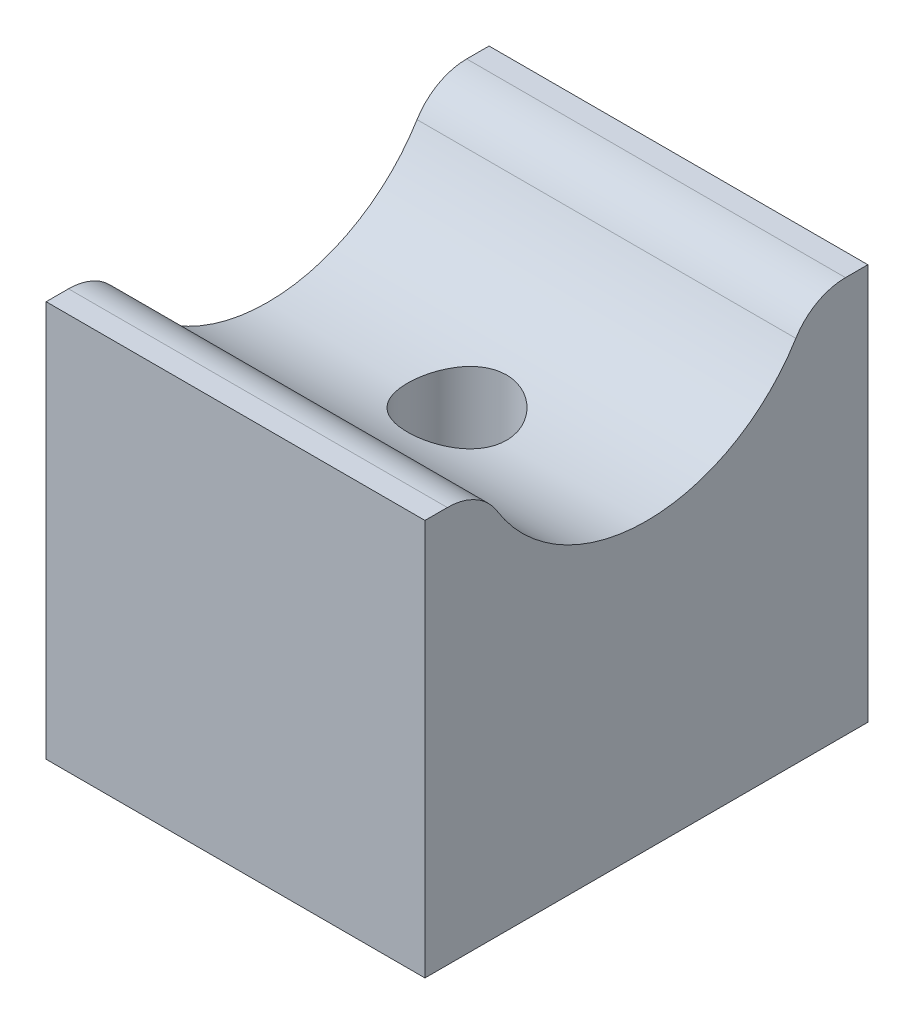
ISO-10303-21;
HEADER;
FILE_DESCRIPTION(('STEP AP214'),'2;1');
FILE_NAME('part.step','',(''),(''),'','','');
FILE_SCHEMA(('AUTOMOTIVE_DESIGN { 1 0 10303 214 1 1 1 1 }'));
ENDSEC;
DATA;
#1=APPLICATION_CONTEXT('core data for automotive mechanical design processes');
#2=APPLICATION_PROTOCOL_DEFINITION('international standard','automotive_design',2000,#1);
#3=PRODUCT_CONTEXT('',#1,'mechanical');
#4=PRODUCT('Part','Part','',(#3));
#5=PRODUCT_RELATED_PRODUCT_CATEGORY('part','',(#4));
#6=PRODUCT_DEFINITION_FORMATION('','',#4);
#7=PRODUCT_DEFINITION_CONTEXT('part definition',#1,'design');
#8=PRODUCT_DEFINITION('design','',#6,#7);
#9=PRODUCT_DEFINITION_SHAPE('','',#8);
#10=(LENGTH_UNIT() NAMED_UNIT(*) SI_UNIT(.MILLI.,.METRE.));
#11=(NAMED_UNIT(*) PLANE_ANGLE_UNIT() SI_UNIT($,.RADIAN.));
#12=(NAMED_UNIT(*) SI_UNIT($,.STERADIAN.) SOLID_ANGLE_UNIT());
#13=UNCERTAINTY_MEASURE_WITH_UNIT(LENGTH_MEASURE(1.E-05),#10,'distance_accuracy_value','');
#14=(GEOMETRIC_REPRESENTATION_CONTEXT(3) GLOBAL_UNCERTAINTY_ASSIGNED_CONTEXT((#13)) GLOBAL_UNIT_ASSIGNED_CONTEXT((#10,
#11,#12)) REPRESENTATION_CONTEXT('',''));
#15=CARTESIAN_POINT('',(0.,0.,0.));
#16=DIRECTION('',(0.,0.,1.));
#17=DIRECTION('',(1.,0.,0.));
#18=AXIS2_PLACEMENT_3D('',#15,#16,#17);
#19=CARTESIAN_POINT('',(16.25,34.,19.));
#20=DIRECTION('',(0.,1.,0.));
#21=DIRECTION('',(0.,0.,1.));
#22=AXIS2_PLACEMENT_3D('',#19,#20,#21);
#23=PLANE('',#22);
#24=DIRECTION('',(0.,0.,-1.));
#25=VECTOR('',#24,1.);
#26=CARTESIAN_POINT('',(16.25,34.,-19.));
#27=LINE('',#26,#25);
#28=CARTESIAN_POINT('',(16.25,34.,19.));
#29=VERTEX_POINT('',#28);
#30=CARTESIAN_POINT('',(16.25,34.,17.0807640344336));
#31=VERTEX_POINT('',#30);
#32=EDGE_CURVE('E109',#29,#31,#27,.T.);
#33=ORIENTED_EDGE('',*,*,#32,.T.);
#34=DIRECTION('',(-1.,0.,0.));
#35=VECTOR('',#34,1.);
#36=CARTESIAN_POINT('',(-16.25,34.,17.0807640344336));
#37=LINE('',#36,#35);
#38=CARTESIAN_POINT('',(-16.25,34.,17.0807640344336));
#39=VERTEX_POINT('',#38);
#40=EDGE_CURVE('E11',#31,#39,#37,.T.);
#41=ORIENTED_EDGE('',*,*,#40,.T.);
#42=DIRECTION('',(0.,0.,1.));
#43=VECTOR('',#42,1.);
#44=CARTESIAN_POINT('',(-16.25,34.,-19.));
#45=LINE('',#44,#43);
#46=CARTESIAN_POINT('',(-16.25,34.,19.));
#47=VERTEX_POINT('',#46);
#48=EDGE_CURVE('E120',#39,#47,#45,.T.);
#49=ORIENTED_EDGE('',*,*,#48,.T.);
#50=DIRECTION('',(1.,0.,0.));
#51=VECTOR('',#50,1.);
#52=CARTESIAN_POINT('',(-16.25,34.,19.));
#53=LINE('',#52,#51);
#54=EDGE_CURVE('E158',#47,#29,#53,.T.);
#55=ORIENTED_EDGE('',*,*,#54,.T.);
#56=EDGE_LOOP('',(#33,#41,#49,#55));
#57=FACE_BOUND('',#56,.T.);
#58=ADVANCED_FACE('F34',(#57),#23,.T.);
#59=CARTESIAN_POINT('',(16.25,34.,-19.));
#60=DIRECTION('',(-1.,0.,0.));
#61=DIRECTION('',(0.,0.,1.));
#62=AXIS2_PLACEMENT_3D('',#59,#60,#61);
#63=PLANE('',#62);
#64=CARTESIAN_POINT('',(16.25,34.,-17.0807640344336));
#65=VERTEX_POINT('',#64);
#66=CARTESIAN_POINT('',(16.25,34.,-19.));
#67=VERTEX_POINT('',#66);
#68=EDGE_CURVE('E102',#65,#67,#27,.T.);
#69=ORIENTED_EDGE('',*,*,#68,.F.);
#70=CARTESIAN_POINT('',(16.25,29.,-17.0807640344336));
#71=DIRECTION('',(-1.,0.,0.));
#72=DIRECTION('',(0.,0.,1.));
#73=AXIS2_PLACEMENT_3D('',#70,#71,#72);
#74=CIRCLE('',#73,5.);
#75=CARTESIAN_POINT('',(16.25,31.6184538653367,-12.8212218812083));
#76=VERTEX_POINT('',#75);
#77=EDGE_CURVE('E47',#65,#76,#74,.F.);
#78=ORIENTED_EDGE('',*,*,#77,.T.);
#79=CARTESIAN_POINT('',(16.25,39.5,0.));
#80=DIRECTION('',(1.,0.,0.));
#81=DIRECTION('',(0.,0.,-1.));
#82=AXIS2_PLACEMENT_3D('',#79,#80,#81);
#83=CIRCLE('',#82,15.05);
#84=CARTESIAN_POINT('',(16.25,31.6184538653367,12.8212218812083));
#85=VERTEX_POINT('',#84);
#86=EDGE_CURVE('E144',#85,#76,#83,.T.);
#87=ORIENTED_EDGE('',*,*,#86,.F.);
#88=CARTESIAN_POINT('',(16.25,29.,17.0807640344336));
#89=DIRECTION('',(-1.,0.,0.));
#90=DIRECTION('',(0.,0.,1.));
#91=AXIS2_PLACEMENT_3D('',#88,#89,#90);
#92=CIRCLE('',#91,5.);
#93=EDGE_CURVE('E54',#85,#31,#92,.F.);
#94=ORIENTED_EDGE('',*,*,#93,.T.);
#95=ORIENTED_EDGE('',*,*,#32,.F.);
#96=DIRECTION('',(0.,-1.,0.));
#97=VECTOR('',#96,1.);
#98=CARTESIAN_POINT('',(16.25,34.,19.));
#99=LINE('',#98,#97);
#100=CARTESIAN_POINT('',(16.25,0.,19.));
#101=VERTEX_POINT('',#100);
#102=EDGE_CURVE('E160',#29,#101,#99,.T.);
#103=ORIENTED_EDGE('',*,*,#102,.T.);
#104=DIRECTION('',(0.,0.,-1.));
#105=VECTOR('',#104,1.);
#106=CARTESIAN_POINT('',(16.25,0.,-19.));
#107=LINE('',#106,#105);
#108=CARTESIAN_POINT('',(16.25,0.,-19.));
#109=VERTEX_POINT('',#108);
#110=EDGE_CURVE('E125',#101,#109,#107,.T.);
#111=ORIENTED_EDGE('',*,*,#110,.T.);
#112=DIRECTION('',(0.,-1.,0.));
#113=VECTOR('',#112,1.);
#114=CARTESIAN_POINT('',(16.25,34.,-19.));
#115=LINE('',#114,#113);
#116=EDGE_CURVE('E115',#67,#109,#115,.T.);
#117=ORIENTED_EDGE('',*,*,#116,.F.);
#118=EDGE_LOOP('',(#69,#78,#87,#94,#95,#103,#111,#117));
#119=FACE_BOUND('',#118,.T.);
#120=ADVANCED_FACE('F122',(#119),#63,.F.);
#121=CARTESIAN_POINT('',(-16.25,34.,-19.));
#122=DIRECTION('',(0.,0.,1.));
#123=DIRECTION('',(1.,0.,0.));
#124=AXIS2_PLACEMENT_3D('',#121,#122,#123);
#125=PLANE('',#124);
#126=DIRECTION('',(-1.,0.,0.));
#127=VECTOR('',#126,1.);
#128=CARTESIAN_POINT('',(-16.25,0.,-19.));
#129=LINE('',#128,#127);
#130=CARTESIAN_POINT('',(-16.25,0.,-19.));
#131=VERTEX_POINT('',#130);
#132=EDGE_CURVE('E164',#109,#131,#129,.T.);
#133=ORIENTED_EDGE('',*,*,#132,.T.);
#134=DIRECTION('',(0.,-1.,0.));
#135=VECTOR('',#134,1.);
#136=CARTESIAN_POINT('',(-16.25,34.,-19.));
#137=LINE('',#136,#135);
#138=CARTESIAN_POINT('',(-16.25,34.,-19.));
#139=VERTEX_POINT('',#138);
#140=EDGE_CURVE('E118',#139,#131,#137,.T.);
#141=ORIENTED_EDGE('',*,*,#140,.F.);
#142=DIRECTION('',(-1.,0.,0.));
#143=VECTOR('',#142,1.);
#144=CARTESIAN_POINT('',(-16.25,34.,-19.));
#145=LINE('',#144,#143);
#146=EDGE_CURVE('E105',#67,#139,#145,.T.);
#147=ORIENTED_EDGE('',*,*,#146,.F.);
#148=ORIENTED_EDGE('',*,*,#116,.T.);
#149=EDGE_LOOP('',(#133,#141,#147,#148));
#150=FACE_BOUND('',#149,.T.);
#151=ADVANCED_FACE('F114',(#150),#125,.F.);
#152=CARTESIAN_POINT('',(-16.25,34.,-19.));
#153=DIRECTION('',(1.,0.,0.));
#154=DIRECTION('',(0.,0.,-1.));
#155=AXIS2_PLACEMENT_3D('',#152,#153,#154);
#156=PLANE('',#155);
#157=CARTESIAN_POINT('',(-16.25,39.5,0.));
#158=DIRECTION('',(1.,0.,0.));
#159=DIRECTION('',(0.,0.,-1.));
#160=AXIS2_PLACEMENT_3D('',#157,#158,#159);
#161=CIRCLE('',#160,15.05);
#162=CARTESIAN_POINT('',(-16.25,31.6184538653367,12.8212218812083));
#163=VERTEX_POINT('',#162);
#164=CARTESIAN_POINT('',(-16.25,31.6184538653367,-12.8212218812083));
#165=VERTEX_POINT('',#164);
#166=EDGE_CURVE('E152',#163,#165,#161,.T.);
#167=ORIENTED_EDGE('',*,*,#166,.T.);
#168=CARTESIAN_POINT('',(-16.25,29.,-17.0807640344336));
#169=DIRECTION('',(1.,0.,0.));
#170=DIRECTION('',(0.,0.,-1.));
#171=AXIS2_PLACEMENT_3D('',#168,#169,#170);
#172=CIRCLE('',#171,5.);
#173=CARTESIAN_POINT('',(-16.25,34.,-17.0807640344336));
#174=VERTEX_POINT('',#173);
#175=EDGE_CURVE('E139',#165,#174,#172,.F.);
#176=ORIENTED_EDGE('',*,*,#175,.T.);
#177=EDGE_CURVE('E157',#139,#174,#45,.T.);
#178=ORIENTED_EDGE('',*,*,#177,.F.);
#179=ORIENTED_EDGE('',*,*,#140,.T.);
#180=DIRECTION('',(0.,0.,1.));
#181=VECTOR('',#180,1.);
#182=CARTESIAN_POINT('',(-16.25,0.,-19.));
#183=LINE('',#182,#181);
#184=CARTESIAN_POINT('',(-16.25,0.,19.));
#185=VERTEX_POINT('',#184);
#186=EDGE_CURVE('E166',#131,#185,#183,.T.);
#187=ORIENTED_EDGE('',*,*,#186,.T.);
#188=DIRECTION('',(0.,-1.,0.));
#189=VECTOR('',#188,1.);
#190=CARTESIAN_POINT('',(-16.25,34.,19.));
#191=LINE('',#190,#189);
#192=EDGE_CURVE('E131',#47,#185,#191,.T.);
#193=ORIENTED_EDGE('',*,*,#192,.F.);
#194=ORIENTED_EDGE('',*,*,#48,.F.);
#195=CARTESIAN_POINT('',(-16.25,29.,17.0807640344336));
#196=DIRECTION('',(1.,0.,0.));
#197=DIRECTION('',(0.,0.,-1.));
#198=AXIS2_PLACEMENT_3D('',#195,#196,#197);
#199=CIRCLE('',#198,5.);
#200=EDGE_CURVE('E137',#39,#163,#199,.F.);
#201=ORIENTED_EDGE('',*,*,#200,.T.);
#202=EDGE_LOOP('',(#167,#176,#178,#179,#187,#193,#194,#201));
#203=FACE_BOUND('',#202,.T.);
#204=ADVANCED_FACE('F156',(#203),#156,.F.);
#205=CARTESIAN_POINT('',(-16.25,34.,19.));
#206=DIRECTION('',(0.,0.,-1.));
#207=DIRECTION('',(-1.,0.,0.));
#208=AXIS2_PLACEMENT_3D('',#205,#206,#207);
#209=PLANE('',#208);
#210=DIRECTION('',(1.,0.,0.));
#211=VECTOR('',#210,1.);
#212=CARTESIAN_POINT('',(-16.25,0.,19.));
#213=LINE('',#212,#211);
#214=EDGE_CURVE('E110',#185,#101,#213,.T.);
#215=ORIENTED_EDGE('',*,*,#214,.T.);
#216=ORIENTED_EDGE('',*,*,#102,.F.);
#217=ORIENTED_EDGE('',*,*,#54,.F.);
#218=ORIENTED_EDGE('',*,*,#192,.T.);
#219=EDGE_LOOP('',(#215,#216,#217,#218));
#220=FACE_BOUND('',#219,.T.);
#221=ADVANCED_FACE('F174',(#220),#209,.F.);
#222=ORIENTED_EDGE('',*,*,#177,.T.);
#223=DIRECTION('',(-1.,0.,0.));
#224=VECTOR('',#223,1.);
#225=CARTESIAN_POINT('',(16.25,34.,-17.0807640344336));
#226=LINE('',#225,#224);
#227=EDGE_CURVE('E62',#174,#65,#226,.F.);
#228=ORIENTED_EDGE('',*,*,#227,.T.);
#229=ORIENTED_EDGE('',*,*,#68,.T.);
#230=ORIENTED_EDGE('',*,*,#146,.T.);
#231=EDGE_LOOP('',(#222,#228,#229,#230));
#232=FACE_BOUND('',#231,.T.);
#233=ADVANCED_FACE('F104',(#232),#23,.T.);
#234=CARTESIAN_POINT('',(16.25,0.,19.));
#235=DIRECTION('',(0.,1.,0.));
#236=DIRECTION('',(0.,0.,1.));
#237=AXIS2_PLACEMENT_3D('',#234,#235,#236);
#238=PLANE('',#237);
#239=CARTESIAN_POINT('',(0.,0.,0.));
#240=DIRECTION('',(0.,-1.,0.));
#241=DIRECTION('',(0.,0.,-1.));
#242=AXIS2_PLACEMENT_3D('',#239,#240,#241);
#243=CIRCLE('',#242,7.50675);
#244=CARTESIAN_POINT('',(0.,0.,-7.50675));
#245=VERTEX_POINT('',#244);
#246=EDGE_CURVE('E217',#245,#245,#243,.T.);
#247=ORIENTED_EDGE('',*,*,#246,.F.);
#248=EDGE_LOOP('',(#247));
#249=FACE_BOUND('',#248,.T.);
#250=ORIENTED_EDGE('',*,*,#110,.F.);
#251=ORIENTED_EDGE('',*,*,#214,.F.);
#252=ORIENTED_EDGE('',*,*,#186,.F.);
#253=ORIENTED_EDGE('',*,*,#132,.F.);
#254=EDGE_LOOP('',(#250,#251,#252,#253));
#255=FACE_BOUND('',#254,.T.);
#256=ADVANCED_FACE('F179',(#249,#255),#238,.F.);
#257=CARTESIAN_POINT('',(-16.25,39.5,0.));
#258=DIRECTION('',(1.,0.,0.));
#259=DIRECTION('',(0.,0.,-1.));
#260=AXIS2_PLACEMENT_3D('',#257,#258,#259);
#261=CYLINDRICAL_SURFACE('',#260,15.05);
#262=CARTESIAN_POINT('',(0.,25.0625487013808,-4.25));
#263=CARTESIAN_POINT('',(0.233558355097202,25.06254526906,-4.24999551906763));
#264=CARTESIAN_POINT('',(0.467162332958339,25.0568192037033,-4.2306816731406));
#265=CARTESIAN_POINT('',(0.927585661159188,25.0346124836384,-4.15410681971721));
#266=CARTESIAN_POINT('',(1.15440209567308,25.0181272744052,-4.0968297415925));
#267=CARTESIAN_POINT('',(1.59452149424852,24.9764149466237,-3.94639219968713));
#268=CARTESIAN_POINT('',(1.80784446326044,24.951201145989,-3.85328637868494));
#269=CARTESIAN_POINT('',(2.21588506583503,24.8948900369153,-3.63400957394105));
#270=CARTESIAN_POINT('',(2.41060062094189,24.8637920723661,-3.50783490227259));
#271=CARTESIAN_POINT('',(2.78135894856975,24.7982390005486,-3.22221635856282));
#272=CARTESIAN_POINT('',(2.95680270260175,24.763718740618,-3.06200969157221));
#273=CARTESIAN_POINT('',(3.27872364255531,24.6957702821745,-2.71451272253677));
#274=CARTESIAN_POINT('',(3.42519750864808,24.6623422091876,-2.52721932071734));
#275=CARTESIAN_POINT('',(3.68756586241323,24.5996115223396,-2.12666239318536));
#276=CARTESIAN_POINT('',(3.80285783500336,24.5703946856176,-1.91298961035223));
#277=CARTESIAN_POINT('',(3.99564827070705,24.5201302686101,-1.46832707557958));
#278=CARTESIAN_POINT('',(4.07315391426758,24.4990811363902,-1.23734062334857));
#279=CARTESIAN_POINT('',(4.18621293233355,24.4679846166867,-0.770866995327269));
#280=CARTESIAN_POINT('',(4.22278691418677,24.4576700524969,-0.535645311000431));
#281=CARTESIAN_POINT('',(4.25616282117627,24.4482675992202,-0.0621936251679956));
#282=CARTESIAN_POINT('',(4.25297217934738,24.4491776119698,0.176035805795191));
#283=CARTESIAN_POINT('',(4.20761274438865,24.4619291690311,0.641611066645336));
#284=CARTESIAN_POINT('',(4.16654775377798,24.4734611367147,0.869074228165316));
#285=CARTESIAN_POINT('',(4.04839759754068,24.5057905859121,1.31373883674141));
#286=CARTESIAN_POINT('',(3.97131026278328,24.5265886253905,1.53093966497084));
#287=CARTESIAN_POINT('',(3.78250346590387,24.575558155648,1.95164256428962));
#288=CARTESIAN_POINT('',(3.67042017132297,24.6038066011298,2.15497202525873));
#289=CARTESIAN_POINT('',(3.4150860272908,24.6646546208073,2.54030239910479));
#290=CARTESIAN_POINT('',(3.27182847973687,24.697255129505,2.72229871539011));
#291=CARTESIAN_POINT('',(2.95241329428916,24.7646142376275,3.06638648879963));
#292=CARTESIAN_POINT('',(2.77529548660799,24.7994085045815,3.22758075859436));
#293=CARTESIAN_POINT('',(2.39618935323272,24.8662386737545,3.51821382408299));
#294=CARTESIAN_POINT('',(2.1941991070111,24.8982743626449,3.64765016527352));
#295=CARTESIAN_POINT('',(1.76894739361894,24.9561165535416,3.87188923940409));
#296=CARTESIAN_POINT('',(1.54553518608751,24.98187358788,3.96641977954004));
#297=CARTESIAN_POINT('',(1.08507463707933,25.0236423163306,4.11627110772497));
#298=CARTESIAN_POINT('',(0.848030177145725,25.0396567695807,4.17160299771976));
#299=CARTESIAN_POINT('',(0.375493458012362,25.0595310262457,4.23988050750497));
#300=CARTESIAN_POINT('',(0.140212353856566,25.0637778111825,4.25417619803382));
#301=CARTESIAN_POINT('',(-0.329384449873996,25.0606999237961,4.24371847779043));
#302=CARTESIAN_POINT('',(-0.563700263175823,25.0533766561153,4.21896980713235));
#303=CARTESIAN_POINT('',(-1.01931971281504,25.0283604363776,4.13232193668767));
#304=CARTESIAN_POINT('',(-1.24079679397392,25.0109015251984,4.0712604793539));
#305=CARTESIAN_POINT('',(-1.67035833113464,24.9678162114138,3.91467564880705));
#306=CARTESIAN_POINT('',(-1.87844088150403,24.9421886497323,3.8191473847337));
#307=CARTESIAN_POINT('',(-2.28088299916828,24.8848795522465,3.59368308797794));
#308=CARTESIAN_POINT('',(-2.47478724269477,24.8530662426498,3.46296862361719));
#309=CARTESIAN_POINT('',(-2.83840365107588,24.7872675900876,3.1717885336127));
#310=CARTESIAN_POINT('',(-3.00811068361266,24.753281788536,3.01131661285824));
#311=CARTESIAN_POINT('',(-3.32425657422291,24.6856145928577,2.65888465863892));
#312=CARTESIAN_POINT('',(-3.46974662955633,24.6519799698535,2.46606261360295));
#313=CARTESIAN_POINT('',(-3.72630868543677,24.5899419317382,2.05796080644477));
#314=CARTESIAN_POINT('',(-3.83738249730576,24.5615382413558,1.84268222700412));
#315=CARTESIAN_POINT('',(-4.02090395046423,24.5133441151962,1.39727731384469));
#316=CARTESIAN_POINT('',(-4.09364391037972,24.4934887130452,1.16727880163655));
#317=CARTESIAN_POINT('',(-4.19924251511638,24.46434150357,0.697670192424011));
#318=CARTESIAN_POINT('',(-4.23211116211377,24.4550470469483,0.458062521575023));
#319=CARTESIAN_POINT('',(-4.2563451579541,24.4482107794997,-0.0151444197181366));
#320=CARTESIAN_POINT('',(-4.24909462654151,24.45027700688,-0.248668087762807));
#321=CARTESIAN_POINT('',(-4.19655338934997,24.4650263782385,-0.711034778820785));
#322=CARTESIAN_POINT('',(-4.15126443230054,24.4777090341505,-0.939878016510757));
#323=CARTESIAN_POINT('',(-4.02475069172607,24.5121722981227,-1.38451014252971));
#324=CARTESIAN_POINT('',(-3.94383661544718,24.5338741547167,-1.60039395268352));
#325=CARTESIAN_POINT('',(-3.74864580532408,24.5841197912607,-2.01564175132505));
#326=CARTESIAN_POINT('',(-3.63436398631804,24.6126646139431,-2.21500321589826));
#327=CARTESIAN_POINT('',(-3.37179974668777,24.6746054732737,-2.59786644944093));
#328=CARTESIAN_POINT('',(-3.22262182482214,24.7081188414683,-2.78073500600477));
#329=CARTESIAN_POINT('',(-2.89615866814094,24.775792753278,-3.11930950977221));
#330=CARTESIAN_POINT('',(-2.71886573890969,24.8099534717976,-3.2750079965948));
#331=CARTESIAN_POINT('',(-2.33577453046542,24.8760674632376,-3.55877919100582));
#332=CARTESIAN_POINT('',(-2.12936493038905,24.907942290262,-3.68604671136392));
#333=CARTESIAN_POINT('',(-1.69720492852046,24.9647056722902,-3.90390475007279));
#334=CARTESIAN_POINT('',(-1.47146577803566,24.989598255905,-3.99451643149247));
#335=CARTESIAN_POINT('',(-1.03920910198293,25.026570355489,-4.12629791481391));
#336=CARTESIAN_POINT('',(-0.834344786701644,25.0399449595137,-4.17256894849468));
#337=CARTESIAN_POINT('',(-0.419665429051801,25.0579350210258,-4.2344197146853));
#338=CARTESIAN_POINT('',(-0.209851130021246,25.0625517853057,-4.25000402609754));
#339=CARTESIAN_POINT('',(0.,25.0625487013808,-4.25));
#340=B_SPLINE_CURVE_WITH_KNOTS('',3,(#262,#263,#264,#265,#266,#267,#268,#269,#270,#271,#272,
#273,#274,#275,#276,#277,#278,#279,#280,#281,#282,#283,#284,#285,#286,#287,#288,#289,#290,#291,
#292,#293,#294,#295,#296,#297,#298,#299,#300,#301,#302,#303,#304,#305,#306,#307,#308,#309,#310,
#311,#312,#313,#314,#315,#316,#317,#318,#319,#320,#321,#322,#323,#324,#325,#326,#327,#328,#329,
#330,#331,#332,#333,#334,#335,#336,#337,#338,#339),.UNSPECIFIED.,.T.,.F.,(4,2,2,2,2,2,2,2,2,2,2,
2,2,2,2,2,2,2,2,2,2,2,2,2,2,2,2,2,2,2,2,2,2,2,2,2,2,2,4),(0.,0.699902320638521,1.40010111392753,
2.09923623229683,2.79844935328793,3.51540062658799,4.23243401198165,4.9624665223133,
5.69236025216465,6.40361820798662,7.11474321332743,7.80577669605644,8.49685179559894,
9.19536528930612,9.89402901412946,10.6166641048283,11.3393550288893,12.0675680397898,
12.795574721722,13.4993394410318,14.2030187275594,14.8910615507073,15.5792020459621,
16.2840350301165,16.9890172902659,17.7171850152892,18.4453144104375,19.1678079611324,
19.8901202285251,20.5876714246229,21.2851905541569,21.9767431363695,22.6684011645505,
23.3802587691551,24.0923115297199,24.8225113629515,25.5522890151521,26.1812419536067,
26.8101010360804),.UNSPECIFIED.);
#341=CARTESIAN_POINT('',(0.,25.0625487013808,-4.25));
#342=VERTEX_POINT('',#341);
#343=EDGE_CURVE('E38',#342,#342,#340,.T.);
#344=ORIENTED_EDGE('',*,*,#343,.T.);
#345=EDGE_LOOP('',(#344));
#346=FACE_BOUND('',#345,.T.);
#347=ORIENTED_EDGE('',*,*,#86,.T.);
#348=DIRECTION('',(1.,0.,0.));
#349=VECTOR('',#348,1.);
#350=CARTESIAN_POINT('',(-16.25,31.6184538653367,-12.8212218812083));
#351=LINE('',#350,#349);
#352=EDGE_CURVE('E129',#76,#165,#351,.F.);
#353=ORIENTED_EDGE('',*,*,#352,.T.);
#354=ORIENTED_EDGE('',*,*,#166,.F.);
#355=DIRECTION('',(1.,0.,0.));
#356=VECTOR('',#355,1.);
#357=CARTESIAN_POINT('',(-16.25,31.6184538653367,12.8212218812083));
#358=LINE('',#357,#356);
#359=EDGE_CURVE('E126',#163,#85,#358,.T.);
#360=ORIENTED_EDGE('',*,*,#359,.T.);
#361=EDGE_LOOP('',(#347,#353,#354,#360));
#362=FACE_BOUND('',#361,.T.);
#363=ADVANCED_FACE('F148',(#346,#362),#261,.F.);
#364=CARTESIAN_POINT('',(-16.25,29.,-17.0807640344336));
#365=DIRECTION('',(1.,0.,0.));
#366=DIRECTION('',(0.,0.,-1.));
#367=AXIS2_PLACEMENT_3D('',#364,#365,#366);
#368=CYLINDRICAL_SURFACE('',#367,5.);
#369=ORIENTED_EDGE('',*,*,#77,.F.);
#370=ORIENTED_EDGE('',*,*,#227,.F.);
#371=ORIENTED_EDGE('',*,*,#175,.F.);
#372=ORIENTED_EDGE('',*,*,#352,.F.);
#373=EDGE_LOOP('',(#369,#370,#371,#372));
#374=FACE_BOUND('',#373,.T.);
#375=ADVANCED_FACE('F154',(#374),#368,.T.);
#376=CARTESIAN_POINT('',(-16.25,29.,17.0807640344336));
#377=DIRECTION('',(1.,0.,0.));
#378=DIRECTION('',(0.,0.,-1.));
#379=AXIS2_PLACEMENT_3D('',#376,#377,#378);
#380=CYLINDRICAL_SURFACE('',#379,5.);
#381=ORIENTED_EDGE('',*,*,#200,.F.);
#382=ORIENTED_EDGE('',*,*,#40,.F.);
#383=ORIENTED_EDGE('',*,*,#93,.F.);
#384=ORIENTED_EDGE('',*,*,#359,.F.);
#385=EDGE_LOOP('',(#381,#382,#383,#384));
#386=FACE_BOUND('',#385,.T.);
#387=ADVANCED_FACE('F36',(#386),#380,.T.);
#388=CARTESIAN_POINT('',(0.,0.,0.));
#389=DIRECTION('',(0.,-1.,0.));
#390=DIRECTION('',(0.,0.,-1.));
#391=AXIS2_PLACEMENT_3D('',#388,#389,#390);
#392=CYLINDRICAL_SURFACE('',#391,4.25);
#393=CARTESIAN_POINT('',(0.,2.,0.));
#394=DIRECTION('',(0.,-1.,0.));
#395=DIRECTION('',(0.,0.,-1.));
#396=AXIS2_PLACEMENT_3D('',#393,#394,#395);
#397=CIRCLE('',#396,4.25);
#398=CARTESIAN_POINT('',(0.,2.,-4.25));
#399=VERTEX_POINT('',#398);
#400=EDGE_CURVE('E219',#399,#399,#397,.T.);
#401=ORIENTED_EDGE('',*,*,#400,.T.);
#402=EDGE_LOOP('',(#401));
#403=FACE_BOUND('',#402,.T.);
#404=ORIENTED_EDGE('',*,*,#343,.F.);
#405=EDGE_LOOP('',(#404));
#406=FACE_BOUND('',#405,.T.);
#407=ADVANCED_FACE('F198',(#403,#406),#392,.F.);
#408=CARTESIAN_POINT('',(4.25,2.,0.));
#409=DIRECTION('',(0.,1.,0.));
#410=DIRECTION('',(0.,0.,1.));
#411=AXIS2_PLACEMENT_3D('',#408,#409,#410);
#412=PLANE('',#411);
#413=ORIENTED_EDGE('',*,*,#400,.F.);
#414=EDGE_LOOP('',(#413));
#415=FACE_BOUND('',#414,.T.);
#416=CARTESIAN_POINT('',(0.,2.,0.));
#417=DIRECTION('',(0.,-1.,0.));
#418=DIRECTION('',(0.,0.,-1.));
#419=AXIS2_PLACEMENT_3D('',#416,#417,#418);
#420=CIRCLE('',#419,7.50675);
#421=CARTESIAN_POINT('',(0.,2.,-7.50675));
#422=VERTEX_POINT('',#421);
#423=EDGE_CURVE('E215',#422,#422,#420,.T.);
#424=ORIENTED_EDGE('',*,*,#423,.T.);
#425=EDGE_LOOP('',(#424));
#426=FACE_BOUND('',#425,.T.);
#427=ADVANCED_FACE('F202',(#415,#426),#412,.F.);
#428=CARTESIAN_POINT('',(0.,0.,0.));
#429=DIRECTION('',(0.,-1.,0.));
#430=DIRECTION('',(0.,0.,-1.));
#431=AXIS2_PLACEMENT_3D('',#428,#429,#430);
#432=CYLINDRICAL_SURFACE('',#431,7.50675);
#433=ORIENTED_EDGE('',*,*,#423,.F.);
#434=EDGE_LOOP('',(#433));
#435=FACE_BOUND('',#434,.T.);
#436=ORIENTED_EDGE('',*,*,#246,.T.);
#437=EDGE_LOOP('',(#436));
#438=FACE_BOUND('',#437,.T.);
#439=ADVANCED_FACE('F206',(#435,#438),#432,.F.);
#440=CLOSED_SHELL('',(#58,#120,#151,#204,#221,#233,#256,#363,#375,#387,#407,#427,#439));
#441=MANIFOLD_SOLID_BREP('B2',#440);
#442=ADVANCED_BREP_SHAPE_REPRESENTATION('',(#18,#441),#14);
#443=SHAPE_DEFINITION_REPRESENTATION(#9,#442);
ENDSEC;
END-ISO-10303-21;
